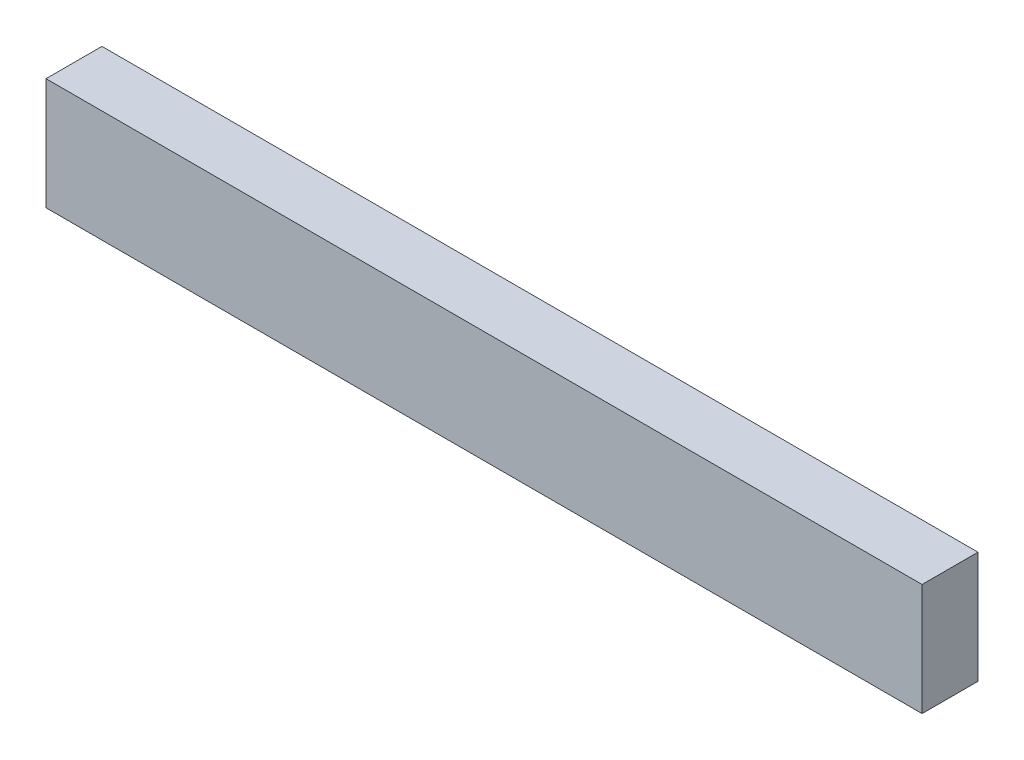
from build123d import *

# Parameters (mm, degrees)
SKETCH1_W      = 19.05
SKETCH1_H      = 38.1
EXTRUDE1_DEPTH = 298.45


with BuildPart() as part:
    # Sketch1 → Extrude1 (new body)
    with BuildSketch(Plane(origin=(0, 0, 0), x_dir=(0, 0, -1), z_dir=(1, 0, 0))):
        with Locations((9.525, 19.05)):
            Rectangle(SKETCH1_W, SKETCH1_H)
    extrude(amount=EXTRUDE1_DEPTH)


solid = part.part
